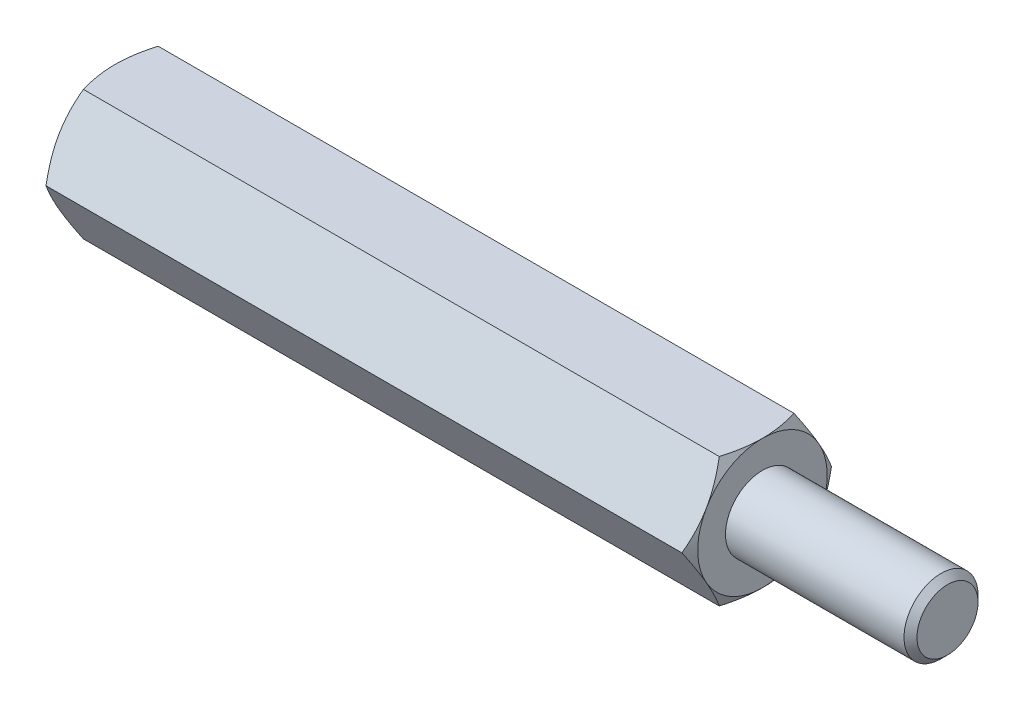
from build123d import *

# Parameters (mm, degrees)
EXTRUDE2_DEPTH = 17.5
SKETCH3_R      = 1.65
EXTRUDE3_DEPTH = 10
SKETCH5_R      = 2
EXTRUDE4_DEPTH = 10
CHAMFER1_SIZE  = 0.35


with BuildPart() as part:
    # Sketch1 → Extrude2 (new, symmetric)
    with BuildSketch(Plane(origin=(0, 0, 0), x_dir=(0, 0, -1), z_dir=(1, 0, 0))):
        Polygon((2.020725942, 3.5), (-2.020725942, 3.5), (-4.041451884, 0), (-2.020725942, -3.5), (2.020725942, -3.5), (4.041451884, 0), align=None)
    extrude(amount=EXTRUDE2_DEPTH, both=True)

    # Sketch2 → Cut-Revolve1 (revolve, cut)
    with BuildSketch(Plane.XY):
        with BuildLine():
            Line((-17.5, 3.5), (-16, 6.098076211))
            ThreePointArc((-16, 6.098076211), (-16.48810136, 7.276457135), (-17.5, 6.5))
            Line((-17.5, 6.5), (-17.5, 3.5))
        make_face()
    cut_revolve1 = revolve(axis=Axis((0, 0, 0), (1, 0, 0)), mode=Mode.SUBTRACT)

    # Mirror1: Cut-Revolve1 across plane
    add(cut_revolve1.mirror(Plane(origin=(0, 0, 0), x_dir=(0, 0, 1), z_dir=(1, 0, 0))), mode=Mode.SUBTRACT)

    # Sketch3 → Extrude3 (cut)
    with BuildSketch(Plane.ZY.offset(17.5)):
        Circle(SKETCH3_R)
    extrude(amount=-EXTRUDE3_DEPTH, mode=Mode.SUBTRACT)

    # Sketch4 → Cut-Revolve2 (revolve, cut)
    with BuildSketch(Plane.XY, mode=Mode.PRIVATE) as cut_revolve2_sk:
        Polygon((-7.5, 0), (-7.5, 1.65), (-6.547372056, 0), align=None)
    revolve(cut_revolve2_sk.sketch.rotate(Axis((-6.547372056, 0, 0), (-1, 0, 0)), 270), axis=Axis((-6.547372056, 0, 0), (-1, 0, 0)), mode=Mode.SUBTRACT)

    # Sketch5 → Extrude4 (add)
    with BuildSketch(Plane(origin=(17.5, 0, 0), x_dir=(0, 0, -1), z_dir=(1, 0, 0))):
        Circle(SKETCH5_R)
    extrude(amount=EXTRUDE4_DEPTH)

    # Chamfer1
    chamfer1_edges = [part.edges().sort_by_distance(p)[0] for p in [
        (27.5, 0, 2),
    ]]
    chamfer(chamfer1_edges, length=CHAMFER1_SIZE)


solid = part.part
